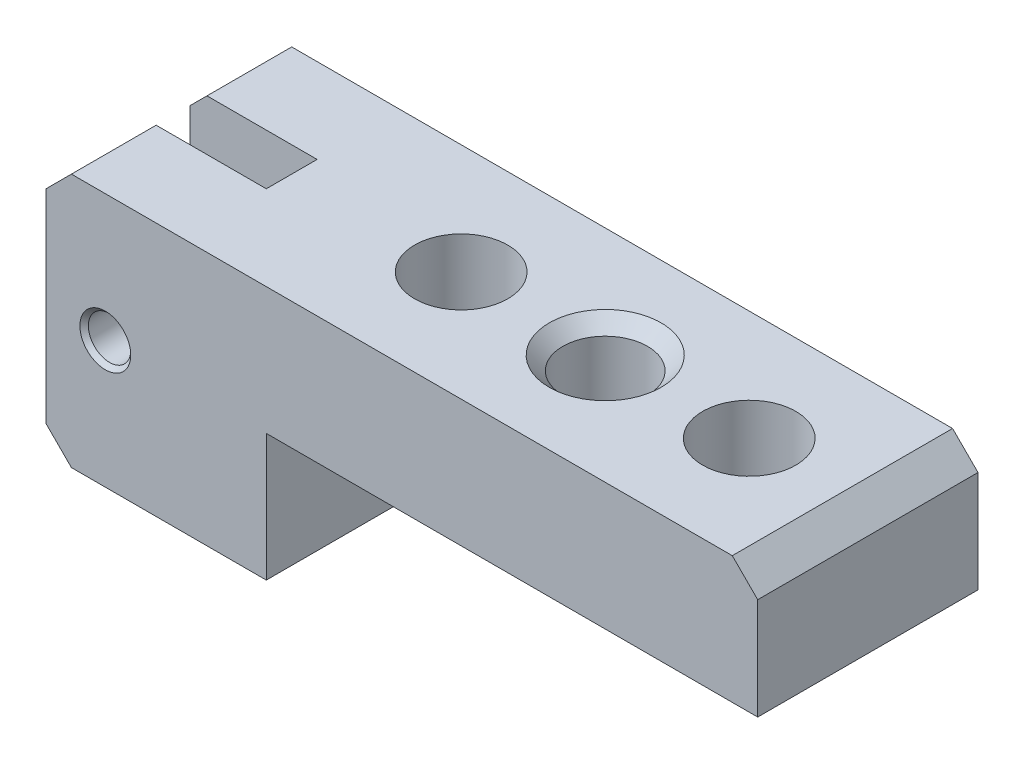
ISO-10303-21;
HEADER;
FILE_DESCRIPTION(('STEP AP214'),'2;1');
FILE_NAME('part.step','',(''),(''),'','','');
FILE_SCHEMA(('AUTOMOTIVE_DESIGN { 1 0 10303 214 1 1 1 1 }'));
ENDSEC;
DATA;
#1=APPLICATION_CONTEXT('core data for automotive mechanical design processes');
#2=APPLICATION_PROTOCOL_DEFINITION('international standard','automotive_design',2000,#1);
#3=PRODUCT_CONTEXT('',#1,'mechanical');
#4=PRODUCT('Part','Part','',(#3));
#5=PRODUCT_RELATED_PRODUCT_CATEGORY('part','',(#4));
#6=PRODUCT_DEFINITION_FORMATION('','',#4);
#7=PRODUCT_DEFINITION_CONTEXT('part definition',#1,'design');
#8=PRODUCT_DEFINITION('design','',#6,#7);
#9=PRODUCT_DEFINITION_SHAPE('','',#8);
#10=(LENGTH_UNIT() NAMED_UNIT(*) SI_UNIT(.MILLI.,.METRE.));
#11=(NAMED_UNIT(*) PLANE_ANGLE_UNIT() SI_UNIT($,.RADIAN.));
#12=(NAMED_UNIT(*) SI_UNIT($,.STERADIAN.) SOLID_ANGLE_UNIT());
#13=UNCERTAINTY_MEASURE_WITH_UNIT(LENGTH_MEASURE(1.E-05),#10,'distance_accuracy_value','');
#14=(GEOMETRIC_REPRESENTATION_CONTEXT(3) GLOBAL_UNCERTAINTY_ASSIGNED_CONTEXT((#13)) GLOBAL_UNIT_ASSIGNED_CONTEXT((#10,
#11,#12)) REPRESENTATION_CONTEXT('',''));
#15=CARTESIAN_POINT('',(0.,0.,0.));
#16=DIRECTION('',(0.,0.,1.));
#17=DIRECTION('',(1.,0.,0.));
#18=AXIS2_PLACEMENT_3D('',#15,#16,#17);
#19=CARTESIAN_POINT('',(-25.9999999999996,4.44089209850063E-13,-26.));
#20=DIRECTION('',(-1.,0.,0.));
#21=DIRECTION('',(0.,0.,1.));
#22=AXIS2_PLACEMENT_3D('',#19,#20,#21);
#23=PLANE('',#22);
#24=DIRECTION('',(0.,0.,1.));
#25=VECTOR('',#24,1.);
#26=CARTESIAN_POINT('',(-25.9999999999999,2.99999999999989,-26.));
#27=LINE('',#26,#25);
#28=CARTESIAN_POINT('',(-25.9999999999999,2.99999999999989,-26.));
#29=VERTEX_POINT('',#28);
#30=CARTESIAN_POINT('',(-25.9999999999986,2.99999999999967,-17.0000000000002));
#31=VERTEX_POINT('',#30);
#32=EDGE_CURVE('E304',#29,#31,#27,.T.);
#33=ORIENTED_EDGE('',*,*,#32,.T.);
#34=DIRECTION('',(0.,1.,0.));
#35=VECTOR('',#34,1.);
#36=CARTESIAN_POINT('',(-25.9999999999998,26.9999999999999,-17.));
#37=LINE('',#36,#35);
#38=CARTESIAN_POINT('',(-25.9999999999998,26.9999999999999,-17.));
#39=VERTEX_POINT('',#38);
#40=EDGE_CURVE('E320',#31,#39,#37,.T.);
#41=ORIENTED_EDGE('',*,*,#40,.T.);
#42=DIRECTION('',(0.,0.,-1.));
#43=VECTOR('',#42,1.);
#44=CARTESIAN_POINT('',(-25.9999999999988,26.9999999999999,-26.0000000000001));
#45=LINE('',#44,#43);
#46=CARTESIAN_POINT('',(-25.9999999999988,26.9999999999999,-26.0000000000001));
#47=VERTEX_POINT('',#46);
#48=EDGE_CURVE('E302',#39,#47,#45,.T.);
#49=ORIENTED_EDGE('',*,*,#48,.T.);
#50=DIRECTION('',(0.,-1.,0.));
#51=VECTOR('',#50,1.);
#52=CARTESIAN_POINT('',(-25.9999999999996,4.44089209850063E-13,-26.));
#53=LINE('',#52,#51);
#54=EDGE_CURVE('E206',#47,#29,#53,.T.);
#55=ORIENTED_EDGE('',*,*,#54,.T.);
#56=EDGE_LOOP('',(#33,#41,#49,#55));
#57=FACE_BOUND('',#56,.T.);
#58=ADVANCED_FACE('F36',(#57),#23,.T.);
#59=CARTESIAN_POINT('',(-18.9999999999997,15.0000000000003,-26.0000000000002));
#60=DIRECTION('',(0.,0.,1.));
#61=DIRECTION('',(1.,0.,0.));
#62=AXIS2_PLACEMENT_3D('',#59,#60,#61);
#63=CYLINDRICAL_SURFACE('',#62,2.5);
#64=CARTESIAN_POINT('',(-18.9999999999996,14.9999999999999,-25.5000000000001));
#65=DIRECTION('',(0.,0.,-1.));
#66=DIRECTION('',(-1.,0.,0.));
#67=AXIS2_PLACEMENT_3D('',#64,#65,#66);
#68=CIRCLE('',#67,2.5);
#69=CARTESIAN_POINT('',(-21.4999999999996,14.9999999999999,-25.5000000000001));
#70=VERTEX_POINT('',#69);
#71=EDGE_CURVE('E258',#70,#70,#68,.T.);
#72=ORIENTED_EDGE('',*,*,#71,.T.);
#73=EDGE_LOOP('',(#72));
#74=FACE_BOUND('',#73,.T.);
#75=CARTESIAN_POINT('',(-18.9999999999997,14.9999999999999,-15.9999999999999));
#76=DIRECTION('',(0.,0.,-1.));
#77=DIRECTION('',(-1.,0.,0.));
#78=AXIS2_PLACEMENT_3D('',#75,#76,#77);
#79=CIRCLE('',#78,2.5);
#80=CARTESIAN_POINT('',(-21.4999999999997,14.9999999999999,-15.9999999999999));
#81=VERTEX_POINT('',#80);
#82=EDGE_CURVE('E216',#81,#81,#79,.F.);
#83=ORIENTED_EDGE('',*,*,#82,.T.);
#84=EDGE_LOOP('',(#83));
#85=FACE_BOUND('',#84,.T.);
#86=ADVANCED_FACE('F370',(#74,#85),#63,.F.);
#87=CARTESIAN_POINT('',(2.22044604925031E-13,15.0000000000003,-26.0000000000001));
#88=DIRECTION('',(1.,0.,0.));
#89=DIRECTION('',(0.,0.,-1.));
#90=AXIS2_PLACEMENT_3D('',#87,#88,#89);
#91=PLANE('',#90);
#92=DIRECTION('',(0.,1.,0.));
#93=VECTOR('',#92,1.);
#94=CARTESIAN_POINT('',(6.66133814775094E-13,14.9999999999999,-7.21644966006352E-13));
#95=LINE('',#94,#93);
#96=CARTESIAN_POINT('',(0.,0.,0.));
#97=VERTEX_POINT('',#96);
#98=CARTESIAN_POINT('',(6.66133814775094E-13,14.9999999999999,-7.21644966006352E-13));
#99=VERTEX_POINT('',#98);
#100=EDGE_CURVE('E212',#97,#99,#95,.T.);
#101=ORIENTED_EDGE('',*,*,#100,.F.);
#102=DIRECTION('',(0.,0.,1.));
#103=VECTOR('',#102,1.);
#104=CARTESIAN_POINT('',(3.33066907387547E-13,2.22044604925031E-13,-25.9999999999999));
#105=LINE('',#104,#103);
#106=CARTESIAN_POINT('',(3.33066907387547E-13,2.22044604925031E-13,-25.9999999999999));
#107=VERTEX_POINT('',#106);
#108=EDGE_CURVE('E229',#107,#97,#105,.T.);
#109=ORIENTED_EDGE('',*,*,#108,.F.);
#110=DIRECTION('',(0.,1.,0.));
#111=VECTOR('',#110,1.);
#112=CARTESIAN_POINT('',(2.22044604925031E-13,15.0000000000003,-26.0000000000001));
#113=LINE('',#112,#111);
#114=CARTESIAN_POINT('',(2.22044604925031E-13,15.0000000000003,-26.0000000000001));
#115=VERTEX_POINT('',#114);
#116=EDGE_CURVE('E193',#107,#115,#113,.T.);
#117=ORIENTED_EDGE('',*,*,#116,.T.);
#118=DIRECTION('',(0.,0.,1.));
#119=VECTOR('',#118,1.);
#120=CARTESIAN_POINT('',(2.22044604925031E-13,15.0000000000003,-26.0000000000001));
#121=LINE('',#120,#119);
#122=EDGE_CURVE('E211',#115,#99,#121,.T.);
#123=ORIENTED_EDGE('',*,*,#122,.T.);
#124=EDGE_LOOP('',(#101,#109,#117,#123));
#125=FACE_BOUND('',#124,.T.);
#126=ADVANCED_FACE('F357',(#125),#91,.T.);
#127=CARTESIAN_POINT('',(3.33066907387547E-13,2.22044604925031E-13,-25.9999999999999));
#128=DIRECTION('',(0.,-1.,0.));
#129=DIRECTION('',(1.,0.,0.));
#130=AXIS2_PLACEMENT_3D('',#127,#128,#129);
#131=PLANE('',#130);
#132=DIRECTION('',(1.,0.,0.));
#133=VECTOR('',#132,1.);
#134=CARTESIAN_POINT('',(0.,0.,0.));
#135=LINE('',#134,#133);
#136=CARTESIAN_POINT('',(-23.0000000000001,4.44089209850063E-13,-2.22044604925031E-13));
#137=VERTEX_POINT('',#136);
#138=EDGE_CURVE('E197',#137,#97,#135,.T.);
#139=ORIENTED_EDGE('',*,*,#138,.F.);
#140=DIRECTION('',(0.,0.,-1.));
#141=VECTOR('',#140,1.);
#142=CARTESIAN_POINT('',(-22.9999999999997,2.22044604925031E-13,-26.));
#143=LINE('',#142,#141);
#144=CARTESIAN_POINT('',(-22.9999999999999,2.22044604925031E-13,-9.99999999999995));
#145=VERTEX_POINT('',#144);
#146=EDGE_CURVE('E161',#137,#145,#143,.T.);
#147=ORIENTED_EDGE('',*,*,#146,.T.);
#148=DIRECTION('',(1.,0.,0.));
#149=VECTOR('',#148,1.);
#150=CARTESIAN_POINT('',(-25.9999999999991,2.22044604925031E-13,-10.0000000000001));
#151=LINE('',#150,#149);
#152=CARTESIAN_POINT('',(-9.99999999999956,6.66133814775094E-13,-10.0000000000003));
#153=VERTEX_POINT('',#152);
#154=EDGE_CURVE('E153',#145,#153,#151,.T.);
#155=ORIENTED_EDGE('',*,*,#154,.T.);
#156=DIRECTION('',(0.,0.,-1.));
#157=VECTOR('',#156,1.);
#158=CARTESIAN_POINT('',(-10.,-2.22044604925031E-13,-16.));
#159=LINE('',#158,#157);
#160=CARTESIAN_POINT('',(-10.,-2.22044604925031E-13,-16.));
#161=VERTEX_POINT('',#160);
#162=EDGE_CURVE('E159',#153,#161,#159,.T.);
#163=ORIENTED_EDGE('',*,*,#162,.T.);
#164=DIRECTION('',(-1.,0.,0.));
#165=VECTOR('',#164,1.);
#166=CARTESIAN_POINT('',(-25.9999999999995,2.22044604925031E-13,-16.));
#167=LINE('',#166,#165);
#168=CARTESIAN_POINT('',(-22.9999999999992,4.44089209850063E-13,-15.9999999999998));
#169=VERTEX_POINT('',#168);
#170=EDGE_CURVE('E177',#161,#169,#167,.T.);
#171=ORIENTED_EDGE('',*,*,#170,.T.);
#172=DIRECTION('',(0.,0.,-1.));
#173=VECTOR('',#172,1.);
#174=CARTESIAN_POINT('',(-22.9999999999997,2.22044604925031E-13,-26.));
#175=LINE('',#174,#173);
#176=CARTESIAN_POINT('',(-22.9999999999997,2.22044604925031E-13,-26.));
#177=VERTEX_POINT('',#176);
#178=EDGE_CURVE('E295',#169,#177,#175,.T.);
#179=ORIENTED_EDGE('',*,*,#178,.T.);
#180=DIRECTION('',(1.,0.,0.));
#181=VECTOR('',#180,1.);
#182=CARTESIAN_POINT('',(3.33066907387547E-13,2.22044604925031E-13,-25.9999999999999));
#183=LINE('',#182,#181);
#184=EDGE_CURVE('E209',#177,#107,#183,.T.);
#185=ORIENTED_EDGE('',*,*,#184,.T.);
#186=ORIENTED_EDGE('',*,*,#108,.T.);
#187=EDGE_LOOP('',(#139,#147,#155,#163,#171,#179,#185,#186));
#188=FACE_BOUND('',#187,.T.);
#189=ADVANCED_FACE('F156',(#188),#131,.T.);
#190=DIRECTION('',(0.,0.,-1.));
#191=VECTOR('',#190,1.);
#192=CARTESIAN_POINT('',(-25.9999999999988,26.9999999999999,-26.0000000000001));
#193=LINE('',#192,#191);
#194=CARTESIAN_POINT('',(-25.9999999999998,26.9999999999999,-1.11022302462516E-13));
#195=VERTEX_POINT('',#194);
#196=CARTESIAN_POINT('',(-26.,27.0000000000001,-9.00000000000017));
#197=VERTEX_POINT('',#196);
#198=EDGE_CURVE('E290',#195,#197,#193,.T.);
#199=ORIENTED_EDGE('',*,*,#198,.T.);
#200=DIRECTION('',(0.,-1.,0.));
#201=VECTOR('',#200,1.);
#202=CARTESIAN_POINT('',(-25.9999999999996,2.99999999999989,-8.99999999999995));
#203=LINE('',#202,#201);
#204=CARTESIAN_POINT('',(-25.9999999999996,2.99999999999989,-8.99999999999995));
#205=VERTEX_POINT('',#204);
#206=EDGE_CURVE('E316',#197,#205,#203,.T.);
#207=ORIENTED_EDGE('',*,*,#206,.T.);
#208=DIRECTION('',(0.,0.,1.));
#209=VECTOR('',#208,1.);
#210=CARTESIAN_POINT('',(-25.9999999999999,2.99999999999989,-26.));
#211=LINE('',#210,#209);
#212=CARTESIAN_POINT('',(-26.,2.99999999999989,0.));
#213=VERTEX_POINT('',#212);
#214=EDGE_CURVE('E293',#205,#213,#211,.T.);
#215=ORIENTED_EDGE('',*,*,#214,.T.);
#216=DIRECTION('',(0.,-1.,0.));
#217=VECTOR('',#216,1.);
#218=CARTESIAN_POINT('',(-25.9999999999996,2.22044604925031E-13,0.));
#219=LINE('',#218,#217);
#220=EDGE_CURVE('E225',#195,#213,#219,.T.);
#221=ORIENTED_EDGE('',*,*,#220,.F.);
#222=EDGE_LOOP('',(#199,#207,#215,#221));
#223=FACE_BOUND('',#222,.T.);
#224=ADVANCED_FACE('F372',(#223),#23,.T.);
#225=CARTESIAN_POINT('',(-25.9999999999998,30.,-26.));
#226=DIRECTION('',(0.,1.,0.));
#227=DIRECTION('',(0.,0.,1.));
#228=AXIS2_PLACEMENT_3D('',#225,#226,#227);
#229=PLANE('',#228);
#230=CARTESIAN_POINT('',(27.0000000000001,30.,-13.0000000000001));
#231=DIRECTION('',(0.,1.,0.));
#232=DIRECTION('',(0.,0.,1.));
#233=AXIS2_PLACEMENT_3D('',#230,#231,#232);
#234=CIRCLE('',#233,6.59999999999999);
#235=CARTESIAN_POINT('',(27.0000000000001,30.,-6.40000000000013));
#236=VERTEX_POINT('',#235);
#237=EDGE_CURVE('E252',#236,#236,#234,.F.);
#238=ORIENTED_EDGE('',*,*,#237,.T.);
#239=EDGE_LOOP('',(#238));
#240=FACE_BOUND('',#239,.T.);
#241=CARTESIAN_POINT('',(44.0000000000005,30.0000000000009,-13.0000000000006));
#242=DIRECTION('',(0.,1.,0.));
#243=DIRECTION('',(0.,0.,1.));
#244=AXIS2_PLACEMENT_3D('',#241,#242,#243);
#245=CIRCLE('',#244,5.5);
#246=CARTESIAN_POINT('',(44.0000000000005,30.0000000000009,-7.50000000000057));
#247=VERTEX_POINT('',#246);
#248=EDGE_CURVE('E249',#247,#247,#245,.T.);
#249=ORIENTED_EDGE('',*,*,#248,.F.);
#250=EDGE_LOOP('',(#249));
#251=FACE_BOUND('',#250,.T.);
#252=CARTESIAN_POINT('',(10.0000000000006,30.0000000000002,-12.9999999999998));
#253=DIRECTION('',(0.,1.,0.));
#254=DIRECTION('',(0.,0.,1.));
#255=AXIS2_PLACEMENT_3D('',#252,#253,#254);
#256=CIRCLE('',#255,5.5);
#257=CARTESIAN_POINT('',(10.0000000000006,30.0000000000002,-7.49999999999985));
#258=VERTEX_POINT('',#257);
#259=EDGE_CURVE('E242',#258,#258,#256,.T.);
#260=ORIENTED_EDGE('',*,*,#259,.F.);
#261=EDGE_LOOP('',(#260));
#262=FACE_BOUND('',#261,.T.);
#263=DIRECTION('',(-1.,0.,0.));
#264=VECTOR('',#263,1.);
#265=CARTESIAN_POINT('',(-25.9999999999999,29.9999999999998,-4.44089209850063E-13));
#266=LINE('',#265,#264);
#267=CARTESIAN_POINT('',(55.0000000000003,30.0000000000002,-1.66533453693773E-13));
#268=VERTEX_POINT('',#267);
#269=CARTESIAN_POINT('',(-22.9999999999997,30.0000000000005,0.));
#270=VERTEX_POINT('',#269);
#271=EDGE_CURVE('E222',#268,#270,#266,.T.);
#272=ORIENTED_EDGE('',*,*,#271,.F.);
#273=DIRECTION('',(0.,0.,-1.));
#274=VECTOR('',#273,1.);
#275=CARTESIAN_POINT('',(54.9999999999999,30.,-26.0000000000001));
#276=LINE('',#275,#274);
#277=CARTESIAN_POINT('',(54.9999999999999,30.,-26.0000000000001));
#278=VERTEX_POINT('',#277);
#279=EDGE_CURVE('E282',#268,#278,#276,.T.);
#280=ORIENTED_EDGE('',*,*,#279,.T.);
#281=DIRECTION('',(-1.,0.,0.));
#282=VECTOR('',#281,1.);
#283=CARTESIAN_POINT('',(-25.9999999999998,30.,-26.));
#284=LINE('',#283,#282);
#285=CARTESIAN_POINT('',(-22.9999999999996,30.,-26.0000000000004));
#286=VERTEX_POINT('',#285);
#287=EDGE_CURVE('E203',#278,#286,#284,.T.);
#288=ORIENTED_EDGE('',*,*,#287,.T.);
#289=DIRECTION('',(0.,0.,1.));
#290=VECTOR('',#289,1.);
#291=CARTESIAN_POINT('',(-22.9999999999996,30.,-26.0000000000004));
#292=LINE('',#291,#290);
#293=CARTESIAN_POINT('',(-22.9999999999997,30.,-16.0000000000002));
#294=VERTEX_POINT('',#293);
#295=EDGE_CURVE('E279',#286,#294,#292,.T.);
#296=ORIENTED_EDGE('',*,*,#295,.T.);
#297=DIRECTION('',(-1.,0.,0.));
#298=VECTOR('',#297,1.);
#299=CARTESIAN_POINT('',(-25.9999999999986,29.9999999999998,-16.0000000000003));
#300=LINE('',#299,#298);
#301=CARTESIAN_POINT('',(-9.99999999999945,30.0000000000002,-15.9999999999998));
#302=VERTEX_POINT('',#301);
#303=EDGE_CURVE('E165',#302,#294,#300,.T.);
#304=ORIENTED_EDGE('',*,*,#303,.F.);
#305=DIRECTION('',(0.,0.,-1.));
#306=VECTOR('',#305,1.);
#307=CARTESIAN_POINT('',(-9.99999999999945,30.0000000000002,-15.9999999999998));
#308=LINE('',#307,#306);
#309=CARTESIAN_POINT('',(-10.,30.,-10.));
#310=VERTEX_POINT('',#309);
#311=EDGE_CURVE('E186',#310,#302,#308,.T.);
#312=ORIENTED_EDGE('',*,*,#311,.F.);
#313=DIRECTION('',(1.,0.,0.));
#314=VECTOR('',#313,1.);
#315=CARTESIAN_POINT('',(-26.,30.,-10.));
#316=LINE('',#315,#314);
#317=CARTESIAN_POINT('',(-22.9999999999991,30.0000000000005,-10.0000000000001));
#318=VERTEX_POINT('',#317);
#319=EDGE_CURVE('E172',#318,#310,#316,.T.);
#320=ORIENTED_EDGE('',*,*,#319,.F.);
#321=DIRECTION('',(0.,0.,1.));
#322=VECTOR('',#321,1.);
#323=CARTESIAN_POINT('',(-22.9999999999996,30.,-26.0000000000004));
#324=LINE('',#323,#322);
#325=EDGE_CURVE('E276',#318,#270,#324,.T.);
#326=ORIENTED_EDGE('',*,*,#325,.T.);
#327=EDGE_LOOP('',(#272,#280,#288,#296,#304,#312,#320,#326));
#328=FACE_BOUND('',#327,.T.);
#329=ADVANCED_FACE('F338',(#240,#251,#262,#328),#229,.T.);
#330=CARTESIAN_POINT('',(58.0000000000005,30.,-26.0000000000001));
#331=DIRECTION('',(1.,0.,0.));
#332=DIRECTION('',(0.,0.,-1.));
#333=AXIS2_PLACEMENT_3D('',#330,#331,#332);
#334=PLANE('',#333);
#335=DIRECTION('',(0.,1.,0.));
#336=VECTOR('',#335,1.);
#337=CARTESIAN_POINT('',(58.0000000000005,30.,-26.0000000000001));
#338=LINE('',#337,#336);
#339=CARTESIAN_POINT('',(58.0000000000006,15.0000000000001,-25.9999999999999));
#340=VERTEX_POINT('',#339);
#341=CARTESIAN_POINT('',(58.0000000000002,26.9999999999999,-25.9999999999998));
#342=VERTEX_POINT('',#341);
#343=EDGE_CURVE('E200',#340,#342,#338,.T.);
#344=ORIENTED_EDGE('',*,*,#343,.T.);
#345=DIRECTION('',(0.,0.,1.));
#346=VECTOR('',#345,1.);
#347=CARTESIAN_POINT('',(58.0000000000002,26.9999999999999,-25.9999999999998));
#348=LINE('',#347,#346);
#349=CARTESIAN_POINT('',(58.,26.9999999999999,0.));
#350=VERTEX_POINT('',#349);
#351=EDGE_CURVE('E267',#342,#350,#348,.T.);
#352=ORIENTED_EDGE('',*,*,#351,.T.);
#353=DIRECTION('',(0.,1.,0.));
#354=VECTOR('',#353,1.);
#355=CARTESIAN_POINT('',(58.0000000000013,30.,-1.66533453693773E-13));
#356=LINE('',#355,#354);
#357=CARTESIAN_POINT('',(58.,15.0000000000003,0.));
#358=VERTEX_POINT('',#357);
#359=EDGE_CURVE('E219',#358,#350,#356,.T.);
#360=ORIENTED_EDGE('',*,*,#359,.F.);
#361=DIRECTION('',(0.,0.,1.));
#362=VECTOR('',#361,1.);
#363=CARTESIAN_POINT('',(58.0000000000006,15.0000000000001,-25.9999999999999));
#364=LINE('',#363,#362);
#365=EDGE_CURVE('E233',#340,#358,#364,.T.);
#366=ORIENTED_EDGE('',*,*,#365,.F.);
#367=EDGE_LOOP('',(#344,#352,#360,#366));
#368=FACE_BOUND('',#367,.T.);
#369=ADVANCED_FACE('F347',(#368),#334,.T.);
#370=CARTESIAN_POINT('',(58.0000000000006,15.0000000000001,-25.9999999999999));
#371=DIRECTION('',(0.,-1.,0.));
#372=DIRECTION('',(1.,0.,0.));
#373=AXIS2_PLACEMENT_3D('',#370,#371,#372);
#374=PLANE('',#373);
#375=CARTESIAN_POINT('',(44.0000000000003,15.0000000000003,-13.0000000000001));
#376=DIRECTION('',(0.,-1.,0.));
#377=DIRECTION('',(1.,0.,0.));
#378=AXIS2_PLACEMENT_3D('',#375,#376,#377);
#379=CIRCLE('',#378,5.5);
#380=CARTESIAN_POINT('',(49.5000000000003,15.0000000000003,-13.0000000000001));
#381=VERTEX_POINT('',#380);
#382=EDGE_CURVE('E246',#381,#381,#379,.T.);
#383=ORIENTED_EDGE('',*,*,#382,.F.);
#384=EDGE_LOOP('',(#383));
#385=FACE_BOUND('',#384,.T.);
#386=CARTESIAN_POINT('',(27.0000000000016,14.9999999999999,-13.0000000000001));
#387=DIRECTION('',(0.,-1.,0.));
#388=DIRECTION('',(1.,0.,0.));
#389=AXIS2_PLACEMENT_3D('',#386,#387,#388);
#390=CIRCLE('',#389,5.);
#391=CARTESIAN_POINT('',(32.0000000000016,14.9999999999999,-13.0000000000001));
#392=VERTEX_POINT('',#391);
#393=EDGE_CURVE('E243',#392,#392,#390,.T.);
#394=ORIENTED_EDGE('',*,*,#393,.F.);
#395=EDGE_LOOP('',(#394));
#396=FACE_BOUND('',#395,.T.);
#397=CARTESIAN_POINT('',(10.0000000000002,14.9999999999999,-13.0000000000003));
#398=DIRECTION('',(0.,-1.,0.));
#399=DIRECTION('',(1.,0.,0.));
#400=AXIS2_PLACEMENT_3D('',#397,#398,#399);
#401=CIRCLE('',#400,5.5);
#402=CARTESIAN_POINT('',(15.5000000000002,14.9999999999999,-13.0000000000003));
#403=VERTEX_POINT('',#402);
#404=EDGE_CURVE('E187',#403,#403,#401,.T.);
#405=ORIENTED_EDGE('',*,*,#404,.F.);
#406=EDGE_LOOP('',(#405));
#407=FACE_BOUND('',#406,.T.);
#408=DIRECTION('',(1.,0.,0.));
#409=VECTOR('',#408,1.);
#410=CARTESIAN_POINT('',(58.,15.0000000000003,0.));
#411=LINE('',#410,#409);
#412=EDGE_CURVE('E215',#99,#358,#411,.T.);
#413=ORIENTED_EDGE('',*,*,#412,.F.);
#414=ORIENTED_EDGE('',*,*,#122,.F.);
#415=DIRECTION('',(1.,0.,0.));
#416=VECTOR('',#415,1.);
#417=CARTESIAN_POINT('',(58.0000000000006,15.0000000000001,-25.9999999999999));
#418=LINE('',#417,#416);
#419=EDGE_CURVE('E196',#115,#340,#418,.T.);
#420=ORIENTED_EDGE('',*,*,#419,.T.);
#421=ORIENTED_EDGE('',*,*,#365,.T.);
#422=EDGE_LOOP('',(#413,#414,#420,#421));
#423=FACE_BOUND('',#422,.T.);
#424=ADVANCED_FACE('F351',(#385,#396,#407,#423),#374,.T.);
#425=CARTESIAN_POINT('',(3.33066907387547E-13,2.22044604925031E-13,-25.9999999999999));
#426=DIRECTION('',(0.,0.,-1.));
#427=DIRECTION('',(-1.,0.,0.));
#428=AXIS2_PLACEMENT_3D('',#425,#426,#427);
#429=PLANE('',#428);
#430=CARTESIAN_POINT('',(-18.9999999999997,15.0000000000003,-26.0000000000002));
#431=DIRECTION('',(0.,0.,-1.));
#432=DIRECTION('',(-1.,0.,0.));
#433=AXIS2_PLACEMENT_3D('',#430,#431,#432);
#434=CIRCLE('',#433,2.99999999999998);
#435=CARTESIAN_POINT('',(-21.9999999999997,15.0000000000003,-26.0000000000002));
#436=VERTEX_POINT('',#435);
#437=EDGE_CURVE('E255',#436,#436,#434,.F.);
#438=ORIENTED_EDGE('',*,*,#437,.T.);
#439=EDGE_LOOP('',(#438));
#440=FACE_BOUND('',#439,.T.);
#441=ORIENTED_EDGE('',*,*,#287,.F.);
#442=DIRECTION('',(-0.707106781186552,0.707106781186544,0.));
#443=VECTOR('',#442,1.);
#444=CARTESIAN_POINT('',(42.500000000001,42.5000000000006,-26.0000000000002));
#445=LINE('',#444,#443);
#446=EDGE_CURVE('E288',#278,#342,#445,.F.);
#447=ORIENTED_EDGE('',*,*,#446,.T.);
#448=ORIENTED_EDGE('',*,*,#343,.F.);
#449=ORIENTED_EDGE('',*,*,#419,.F.);
#450=ORIENTED_EDGE('',*,*,#116,.F.);
#451=ORIENTED_EDGE('',*,*,#184,.F.);
#452=DIRECTION('',(0.707106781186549,-0.707106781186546,0.));
#453=VECTOR('',#452,1.);
#454=CARTESIAN_POINT('',(-11.4999999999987,-11.4999999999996,-26.0000000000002));
#455=LINE('',#454,#453);
#456=EDGE_CURVE('E286',#177,#29,#455,.F.);
#457=ORIENTED_EDGE('',*,*,#456,.T.);
#458=ORIENTED_EDGE('',*,*,#54,.F.);
#459=DIRECTION('',(-0.707106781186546,-0.707106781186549,0.));
#460=VECTOR('',#459,1.);
#461=CARTESIAN_POINT('',(-26.4999999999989,26.5000000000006,-26.));
#462=LINE('',#461,#460);
#463=EDGE_CURVE('E284',#47,#286,#462,.F.);
#464=ORIENTED_EDGE('',*,*,#463,.T.);
#465=EDGE_LOOP('',(#441,#447,#448,#449,#450,#451,#457,#458,#464));
#466=FACE_BOUND('',#465,.T.);
#467=ADVANCED_FACE('F334',(#440,#466),#429,.T.);
#468=CARTESIAN_POINT('',(0.,0.,0.));
#469=DIRECTION('',(0.,0.,-1.));
#470=DIRECTION('',(-1.,0.,0.));
#471=AXIS2_PLACEMENT_3D('',#468,#469,#470);
#472=PLANE('',#471);
#473=CARTESIAN_POINT('',(-18.9999999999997,14.9999999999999,0.));
#474=DIRECTION('',(0.,0.,-1.));
#475=DIRECTION('',(-1.,0.,0.));
#476=AXIS2_PLACEMENT_3D('',#473,#474,#475);
#477=CIRCLE('',#476,3.00000000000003);
#478=CARTESIAN_POINT('',(-21.9999999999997,14.9999999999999,0.));
#479=VERTEX_POINT('',#478);
#480=EDGE_CURVE('E264',#479,#479,#477,.T.);
#481=ORIENTED_EDGE('',*,*,#480,.T.);
#482=EDGE_LOOP('',(#481));
#483=FACE_BOUND('',#482,.T.);
#484=ORIENTED_EDGE('',*,*,#359,.T.);
#485=DIRECTION('',(0.707106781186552,-0.707106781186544,0.));
#486=VECTOR('',#485,1.);
#487=CARTESIAN_POINT('',(58.,26.9999999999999,0.));
#488=LINE('',#487,#486);
#489=EDGE_CURVE('E274',#350,#268,#488,.F.);
#490=ORIENTED_EDGE('',*,*,#489,.T.);
#491=ORIENTED_EDGE('',*,*,#271,.T.);
#492=DIRECTION('',(0.707106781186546,0.707106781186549,0.));
#493=VECTOR('',#492,1.);
#494=CARTESIAN_POINT('',(-22.9999999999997,30.0000000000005,0.));
#495=LINE('',#494,#493);
#496=EDGE_CURVE('E270',#270,#195,#495,.F.);
#497=ORIENTED_EDGE('',*,*,#496,.T.);
#498=ORIENTED_EDGE('',*,*,#220,.T.);
#499=DIRECTION('',(-0.707106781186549,0.707106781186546,0.));
#500=VECTOR('',#499,1.);
#501=CARTESIAN_POINT('',(-26.,2.99999999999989,0.));
#502=LINE('',#501,#500);
#503=EDGE_CURVE('E272',#213,#137,#502,.F.);
#504=ORIENTED_EDGE('',*,*,#503,.T.);
#505=ORIENTED_EDGE('',*,*,#138,.T.);
#506=ORIENTED_EDGE('',*,*,#100,.T.);
#507=ORIENTED_EDGE('',*,*,#412,.T.);
#508=EDGE_LOOP('',(#484,#490,#491,#497,#498,#504,#505,#506,#507));
#509=FACE_BOUND('',#508,.T.);
#510=ADVANCED_FACE('F401',(#483,#509),#472,.F.);
#511=CARTESIAN_POINT('',(-18.9999999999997,15.0000000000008,-0.5));
#512=DIRECTION('',(0.,0.,-1.));
#513=DIRECTION('',(-1.,0.,0.));
#514=AXIS2_PLACEMENT_3D('',#511,#512,#513);
#515=CIRCLE('',#514,2.5);
#516=CARTESIAN_POINT('',(-21.4999999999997,15.0000000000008,-0.5));
#517=VERTEX_POINT('',#516);
#518=EDGE_CURVE('E261',#517,#517,#515,.F.);
#519=ORIENTED_EDGE('',*,*,#518,.T.);
#520=EDGE_LOOP('',(#519));
#521=FACE_BOUND('',#520,.T.);
#522=CARTESIAN_POINT('',(-18.9999999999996,14.9999999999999,-10.0000000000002));
#523=DIRECTION('',(0.,0.,1.));
#524=DIRECTION('',(1.,0.,0.));
#525=AXIS2_PLACEMENT_3D('',#522,#523,#524);
#526=CIRCLE('',#525,2.5);
#527=CARTESIAN_POINT('',(-16.4999999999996,14.9999999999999,-10.0000000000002));
#528=VERTEX_POINT('',#527);
#529=EDGE_CURVE('E191',#528,#528,#526,.F.);
#530=ORIENTED_EDGE('',*,*,#529,.T.);
#531=EDGE_LOOP('',(#530));
#532=FACE_BOUND('',#531,.T.);
#533=ADVANCED_FACE('F378',(#521,#532),#63,.F.);
#534=CARTESIAN_POINT('',(-25.9999999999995,2.22044604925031E-13,-16.));
#535=DIRECTION('',(0.,0.,-1.));
#536=DIRECTION('',(-1.,0.,0.));
#537=AXIS2_PLACEMENT_3D('',#534,#535,#536);
#538=PLANE('',#537);
#539=DIRECTION('',(0.707106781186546,0.707106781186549,0.));
#540=VECTOR('',#539,1.);
#541=CARTESIAN_POINT('',(-22.9999999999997,30.,-16.0000000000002));
#542=LINE('',#541,#540);
#543=CARTESIAN_POINT('',(-24.9999999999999,28.0000000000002,-16.0000000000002));
#544=VERTEX_POINT('',#543);
#545=EDGE_CURVE('E307',#294,#544,#542,.F.);
#546=ORIENTED_EDGE('',*,*,#545,.T.);
#547=DIRECTION('',(0.,-1.,0.));
#548=VECTOR('',#547,1.);
#549=CARTESIAN_POINT('',(-24.9999999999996,3.00000000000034,-16.));
#550=LINE('',#549,#548);
#551=CARTESIAN_POINT('',(-24.9999999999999,2.,-16.));
#552=VERTEX_POINT('',#551);
#553=EDGE_CURVE('E44',#544,#552,#550,.T.);
#554=ORIENTED_EDGE('',*,*,#553,.T.);
#555=DIRECTION('',(-0.707106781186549,0.707106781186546,0.));
#556=VECTOR('',#555,1.);
#557=CARTESIAN_POINT('',(-25.9999999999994,3.00000000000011,-15.9999999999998));
#558=LINE('',#557,#556);
#559=EDGE_CURVE('E309',#552,#169,#558,.F.);
#560=ORIENTED_EDGE('',*,*,#559,.T.);
#561=ORIENTED_EDGE('',*,*,#170,.F.);
#562=DIRECTION('',(0.,1.,0.));
#563=VECTOR('',#562,1.);
#564=CARTESIAN_POINT('',(-10.,-2.22044604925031E-13,-16.));
#565=LINE('',#564,#563);
#566=EDGE_CURVE('E176',#161,#302,#565,.T.);
#567=ORIENTED_EDGE('',*,*,#566,.T.);
#568=ORIENTED_EDGE('',*,*,#303,.T.);
#569=EDGE_LOOP('',(#546,#554,#560,#561,#567,#568));
#570=FACE_BOUND('',#569,.T.);
#571=ORIENTED_EDGE('',*,*,#82,.F.);
#572=EDGE_LOOP('',(#571));
#573=FACE_BOUND('',#572,.T.);
#574=ADVANCED_FACE('F409',(#570,#573),#538,.F.);
#575=CARTESIAN_POINT('',(-25.9999999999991,2.22044604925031E-13,-10.0000000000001));
#576=DIRECTION('',(0.,0.,1.));
#577=DIRECTION('',(1.,0.,0.));
#578=AXIS2_PLACEMENT_3D('',#575,#576,#577);
#579=PLANE('',#578);
#580=DIRECTION('',(0.707106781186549,-0.707106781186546,0.));
#581=VECTOR('',#580,1.);
#582=CARTESIAN_POINT('',(-25.9999999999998,2.99999999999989,-10.0000000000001));
#583=LINE('',#582,#581);
#584=CARTESIAN_POINT('',(-24.9999999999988,2.,-10.));
#585=VERTEX_POINT('',#584);
#586=EDGE_CURVE('E300',#145,#585,#583,.F.);
#587=ORIENTED_EDGE('',*,*,#586,.T.);
#588=DIRECTION('',(0.,1.,0.));
#589=VECTOR('',#588,1.);
#590=CARTESIAN_POINT('',(-24.999999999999,26.9999999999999,-10.0000000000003));
#591=LINE('',#590,#589);
#592=CARTESIAN_POINT('',(-24.9999999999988,27.9999999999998,-10.0000000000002));
#593=VERTEX_POINT('',#592);
#594=EDGE_CURVE('E311',#585,#593,#591,.T.);
#595=ORIENTED_EDGE('',*,*,#594,.T.);
#596=DIRECTION('',(-0.707106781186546,-0.707106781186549,0.));
#597=VECTOR('',#596,1.);
#598=CARTESIAN_POINT('',(-22.9999999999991,30.0000000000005,-10.0000000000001));
#599=LINE('',#598,#597);
#600=EDGE_CURVE('E298',#593,#318,#599,.F.);
#601=ORIENTED_EDGE('',*,*,#600,.T.);
#602=ORIENTED_EDGE('',*,*,#319,.T.);
#603=DIRECTION('',(0.,1.,0.));
#604=VECTOR('',#603,1.);
#605=CARTESIAN_POINT('',(-9.99999999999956,6.66133814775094E-13,-10.0000000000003));
#606=LINE('',#605,#604);
#607=EDGE_CURVE('E168',#153,#310,#606,.T.);
#608=ORIENTED_EDGE('',*,*,#607,.F.);
#609=ORIENTED_EDGE('',*,*,#154,.F.);
#610=EDGE_LOOP('',(#587,#595,#601,#602,#608,#609));
#611=FACE_BOUND('',#610,.T.);
#612=ORIENTED_EDGE('',*,*,#529,.F.);
#613=EDGE_LOOP('',(#612));
#614=FACE_BOUND('',#613,.T.);
#615=ADVANCED_FACE('F169',(#611,#614),#579,.F.);
#616=CARTESIAN_POINT('',(-10.,-2.22044604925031E-13,-16.));
#617=DIRECTION('',(1.,0.,0.));
#618=DIRECTION('',(0.,0.,-1.));
#619=AXIS2_PLACEMENT_3D('',#616,#617,#618);
#620=PLANE('',#619);
#621=ORIENTED_EDGE('',*,*,#311,.T.);
#622=ORIENTED_EDGE('',*,*,#566,.F.);
#623=ORIENTED_EDGE('',*,*,#162,.F.);
#624=ORIENTED_EDGE('',*,*,#607,.T.);
#625=EDGE_LOOP('',(#621,#622,#623,#624));
#626=FACE_BOUND('',#625,.T.);
#627=ADVANCED_FACE('F179',(#626),#620,.F.);
#628=CARTESIAN_POINT('',(10.0000000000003,2.22044604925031E-13,-12.9999999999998));
#629=DIRECTION('',(0.,1.,0.));
#630=DIRECTION('',(0.,0.,1.));
#631=AXIS2_PLACEMENT_3D('',#628,#629,#630);
#632=CYLINDRICAL_SURFACE('',#631,5.5);
#633=ORIENTED_EDGE('',*,*,#404,.T.);
#634=EDGE_LOOP('',(#633));
#635=FACE_BOUND('',#634,.T.);
#636=ORIENTED_EDGE('',*,*,#259,.T.);
#637=EDGE_LOOP('',(#636));
#638=FACE_BOUND('',#637,.T.);
#639=ADVANCED_FACE('F418',(#635,#638),#632,.F.);
#640=CARTESIAN_POINT('',(27.0000000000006,0.,-13.0000000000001));
#641=DIRECTION('',(0.,1.,0.));
#642=DIRECTION('',(0.,0.,1.));
#643=AXIS2_PLACEMENT_3D('',#640,#641,#642);
#644=CYLINDRICAL_SURFACE('',#643,5.);
#645=CARTESIAN_POINT('',(27.0000000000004,28.4000000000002,-13.0000000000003));
#646=DIRECTION('',(0.,1.,0.));
#647=DIRECTION('',(0.,0.,1.));
#648=AXIS2_PLACEMENT_3D('',#645,#646,#647);
#649=CIRCLE('',#648,5.);
#650=CARTESIAN_POINT('',(27.0000000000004,28.4000000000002,-8.00000000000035));
#651=VERTEX_POINT('',#650);
#652=EDGE_CURVE('E232',#651,#651,#649,.T.);
#653=ORIENTED_EDGE('',*,*,#652,.T.);
#654=EDGE_LOOP('',(#653));
#655=FACE_BOUND('',#654,.T.);
#656=ORIENTED_EDGE('',*,*,#393,.T.);
#657=EDGE_LOOP('',(#656));
#658=FACE_BOUND('',#657,.T.);
#659=ADVANCED_FACE('F423',(#655,#658),#644,.F.);
#660=CARTESIAN_POINT('',(44.,-2.22044604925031E-13,-13.0000000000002));
#661=DIRECTION('',(0.,1.,0.));
#662=DIRECTION('',(0.,0.,1.));
#663=AXIS2_PLACEMENT_3D('',#660,#661,#662);
#664=CYLINDRICAL_SURFACE('',#663,5.5);
#665=ORIENTED_EDGE('',*,*,#382,.T.);
#666=EDGE_LOOP('',(#665));
#667=FACE_BOUND('',#666,.T.);
#668=ORIENTED_EDGE('',*,*,#248,.T.);
#669=EDGE_LOOP('',(#668));
#670=FACE_BOUND('',#669,.T.);
#671=ADVANCED_FACE('F427',(#667,#670),#664,.F.);
#672=CARTESIAN_POINT('',(27.0000000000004,28.4000000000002,-13.0000000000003));
#673=DIRECTION('',(0.,1.,0.));
#674=DIRECTION('',(0.,0.,1.));
#675=AXIS2_PLACEMENT_3D('',#672,#673,#674);
#676=CONICAL_SURFACE('',#675,5.,0.785398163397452);
#677=ORIENTED_EDGE('',*,*,#237,.F.);
#678=EDGE_LOOP('',(#677));
#679=FACE_BOUND('',#678,.T.);
#680=ORIENTED_EDGE('',*,*,#652,.F.);
#681=EDGE_LOOP('',(#680));
#682=FACE_BOUND('',#681,.T.);
#683=ADVANCED_FACE('F430',(#679,#682),#676,.F.);
#684=CARTESIAN_POINT('',(-18.9999999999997,15.0000000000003,-26.0000000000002));
#685=DIRECTION('',(0.,0.,-1.));
#686=DIRECTION('',(-1.,0.,0.));
#687=AXIS2_PLACEMENT_3D('',#684,#685,#686);
#688=CONICAL_SURFACE('',#687,2.99999999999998,0.785398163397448);
#689=ORIENTED_EDGE('',*,*,#71,.F.);
#690=EDGE_LOOP('',(#689));
#691=FACE_BOUND('',#690,.T.);
#692=ORIENTED_EDGE('',*,*,#437,.F.);
#693=EDGE_LOOP('',(#692));
#694=FACE_BOUND('',#693,.T.);
#695=ADVANCED_FACE('F435',(#691,#694),#688,.F.);
#696=CARTESIAN_POINT('',(-18.9999999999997,15.0000000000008,-0.5));
#697=DIRECTION('',(0.,0.,1.));
#698=DIRECTION('',(1.,0.,0.));
#699=AXIS2_PLACEMENT_3D('',#696,#697,#698);
#700=CONICAL_SURFACE('',#699,2.5,0.785398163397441);
#701=ORIENTED_EDGE('',*,*,#480,.F.);
#702=EDGE_LOOP('',(#701));
#703=FACE_BOUND('',#702,.T.);
#704=ORIENTED_EDGE('',*,*,#518,.F.);
#705=EDGE_LOOP('',(#704));
#706=FACE_BOUND('',#705,.T.);
#707=ADVANCED_FACE('F465',(#703,#706),#700,.F.);
#708=CARTESIAN_POINT('',(58.0000000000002,26.9999999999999,-25.9999999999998));
#709=DIRECTION('',(-0.707106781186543,-0.707106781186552,0.));
#710=DIRECTION('',(0.,0.,1.));
#711=AXIS2_PLACEMENT_3D('',#708,#709,#710);
#712=PLANE('',#711);
#713=ORIENTED_EDGE('',*,*,#446,.F.);
#714=ORIENTED_EDGE('',*,*,#279,.F.);
#715=ORIENTED_EDGE('',*,*,#489,.F.);
#716=ORIENTED_EDGE('',*,*,#351,.F.);
#717=EDGE_LOOP('',(#713,#714,#715,#716));
#718=FACE_BOUND('',#717,.T.);
#719=ADVANCED_FACE('F342',(#718),#712,.F.);
#720=CARTESIAN_POINT('',(-25.9999999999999,2.99999999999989,-26.));
#721=DIRECTION('',(0.707106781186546,0.707106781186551,0.));
#722=DIRECTION('',(0.,0.,1.));
#723=AXIS2_PLACEMENT_3D('',#720,#721,#722);
#724=PLANE('',#723);
#725=ORIENTED_EDGE('',*,*,#214,.F.);
#726=DIRECTION('',(-0.577350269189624,0.577350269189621,0.577350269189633));
#727=VECTOR('',#726,1.);
#728=CARTESIAN_POINT('',(-20.3333333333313,-2.66666666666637,-14.6666666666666));
#729=LINE('',#728,#727);
#730=EDGE_CURVE('E318',#205,#585,#729,.F.);
#731=ORIENTED_EDGE('',*,*,#730,.T.);
#732=ORIENTED_EDGE('',*,*,#586,.F.);
#733=ORIENTED_EDGE('',*,*,#146,.F.);
#734=ORIENTED_EDGE('',*,*,#503,.F.);
#735=EDGE_LOOP('',(#725,#731,#732,#733,#734));
#736=FACE_BOUND('',#735,.T.);
#737=ADVANCED_FACE('F396',(#736),#724,.F.);
#738=CARTESIAN_POINT('',(-25.9999999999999,2.99999999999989,-26.));
#739=DIRECTION('',(0.707106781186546,0.707106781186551,0.));
#740=DIRECTION('',(0.,0.,1.));
#741=AXIS2_PLACEMENT_3D('',#738,#739,#740);
#742=PLANE('',#741);
#743=ORIENTED_EDGE('',*,*,#559,.F.);
#744=DIRECTION('',(0.577350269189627,-0.577350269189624,0.577350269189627));
#745=VECTOR('',#744,1.);
#746=CARTESIAN_POINT('',(-28.9999999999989,5.99999999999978,-20.));
#747=LINE('',#746,#745);
#748=EDGE_CURVE('E11',#552,#31,#747,.F.);
#749=ORIENTED_EDGE('',*,*,#748,.T.);
#750=ORIENTED_EDGE('',*,*,#32,.F.);
#751=ORIENTED_EDGE('',*,*,#456,.F.);
#752=ORIENTED_EDGE('',*,*,#178,.F.);
#753=EDGE_LOOP('',(#743,#749,#750,#751,#752));
#754=FACE_BOUND('',#753,.T.);
#755=ADVANCED_FACE('F361',(#754),#742,.F.);
#756=CARTESIAN_POINT('',(-22.9999999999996,30.,-26.0000000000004));
#757=DIRECTION('',(0.707106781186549,-0.707106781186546,0.));
#758=DIRECTION('',(0.,0.,1.));
#759=AXIS2_PLACEMENT_3D('',#756,#757,#758);
#760=PLANE('',#759);
#761=ORIENTED_EDGE('',*,*,#48,.F.);
#762=DIRECTION('',(-0.577350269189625,-0.577350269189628,-0.577350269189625));
#763=VECTOR('',#762,1.);
#764=CARTESIAN_POINT('',(-26.9999999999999,26.,-18.0000000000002));
#765=LINE('',#764,#763);
#766=EDGE_CURVE('E58',#39,#544,#765,.F.);
#767=ORIENTED_EDGE('',*,*,#766,.T.);
#768=ORIENTED_EDGE('',*,*,#545,.F.);
#769=ORIENTED_EDGE('',*,*,#295,.F.);
#770=ORIENTED_EDGE('',*,*,#463,.F.);
#771=EDGE_LOOP('',(#761,#767,#768,#769,#770));
#772=FACE_BOUND('',#771,.T.);
#773=ADVANCED_FACE('F330',(#772),#760,.F.);
#774=CARTESIAN_POINT('',(-22.9999999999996,30.,-26.0000000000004));
#775=DIRECTION('',(0.707106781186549,-0.707106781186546,0.));
#776=DIRECTION('',(0.,0.,1.));
#777=AXIS2_PLACEMENT_3D('',#774,#775,#776);
#778=PLANE('',#777);
#779=ORIENTED_EDGE('',*,*,#600,.F.);
#780=DIRECTION('',(0.577350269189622,0.577350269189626,-0.57735026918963));
#781=VECTOR('',#780,1.);
#782=CARTESIAN_POINT('',(-18.3333333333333,34.6666666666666,-16.6666666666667));
#783=LINE('',#782,#781);
#784=EDGE_CURVE('E314',#593,#197,#783,.F.);
#785=ORIENTED_EDGE('',*,*,#784,.T.);
#786=ORIENTED_EDGE('',*,*,#198,.F.);
#787=ORIENTED_EDGE('',*,*,#496,.F.);
#788=ORIENTED_EDGE('',*,*,#325,.F.);
#789=EDGE_LOOP('',(#779,#785,#786,#787,#788));
#790=FACE_BOUND('',#789,.T.);
#791=ADVANCED_FACE('F367',(#790),#778,.F.);
#792=CARTESIAN_POINT('',(-24.9999999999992,-2.22044604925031E-13,-10.));
#793=DIRECTION('',(-0.707106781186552,0.,-0.707106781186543));
#794=DIRECTION('',(0.,-1.,0.));
#795=AXIS2_PLACEMENT_3D('',#792,#793,#794);
#796=PLANE('',#795);
#797=ORIENTED_EDGE('',*,*,#730,.F.);
#798=ORIENTED_EDGE('',*,*,#206,.F.);
#799=ORIENTED_EDGE('',*,*,#784,.F.);
#800=ORIENTED_EDGE('',*,*,#594,.F.);
#801=EDGE_LOOP('',(#797,#798,#799,#800));
#802=FACE_BOUND('',#801,.T.);
#803=ADVANCED_FACE('F363',(#802),#796,.T.);
#804=CARTESIAN_POINT('',(-25.9999999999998,0.,-17.));
#805=DIRECTION('',(-0.707106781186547,0.,0.707106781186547));
#806=DIRECTION('',(0.,-1.,0.));
#807=AXIS2_PLACEMENT_3D('',#804,#805,#806);
#808=PLANE('',#807);
#809=ORIENTED_EDGE('',*,*,#748,.F.);
#810=ORIENTED_EDGE('',*,*,#553,.F.);
#811=ORIENTED_EDGE('',*,*,#766,.F.);
#812=ORIENTED_EDGE('',*,*,#40,.F.);
#813=EDGE_LOOP('',(#809,#810,#811,#812));
#814=FACE_BOUND('',#813,.T.);
#815=ADVANCED_FACE('F38',(#814),#808,.T.);
#816=CLOSED_SHELL('',(#58,#86,#126,#189,#224,#329,#369,#424,#467,#510,#533,#574,#615,#627,#639,
#659,#671,#683,#695,#707,#719,#737,#755,#773,#791,#803,#815));
#817=MANIFOLD_SOLID_BREP('B2',#816);
#818=ADVANCED_BREP_SHAPE_REPRESENTATION('',(#18,#817),#14);
#819=SHAPE_DEFINITION_REPRESENTATION(#9,#818);
ENDSEC;
END-ISO-10303-21;
